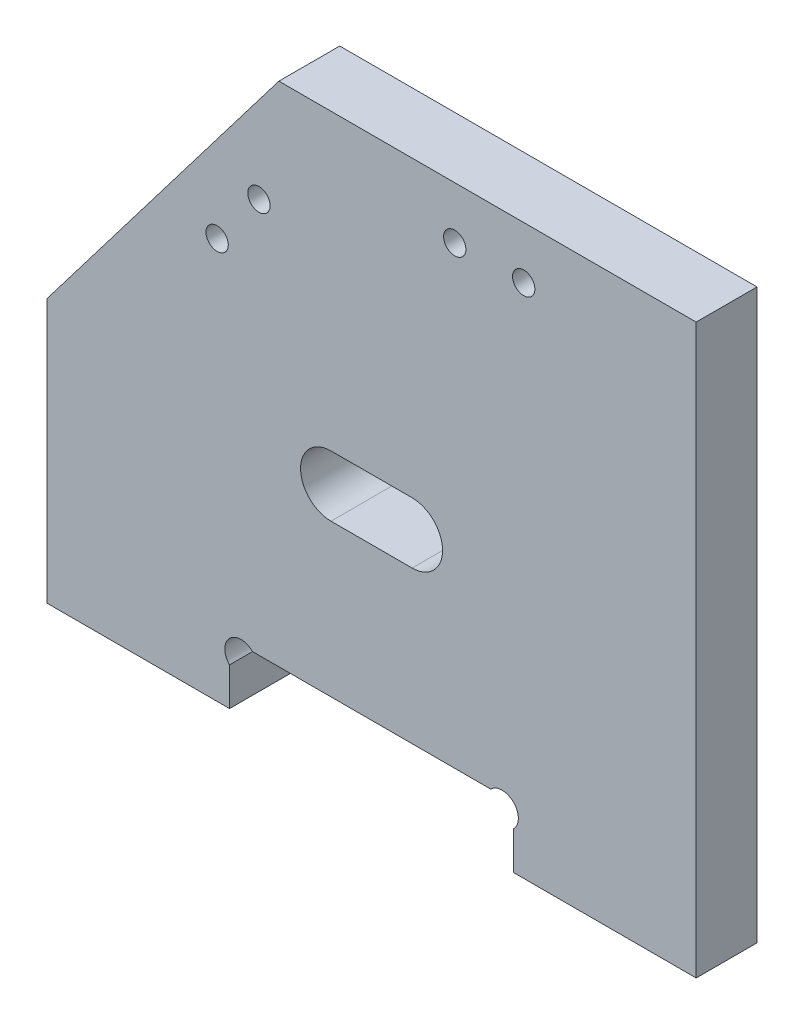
ISO-10303-21;
HEADER;
FILE_DESCRIPTION(('STEP AP214'),'2;1');
FILE_NAME('part.step','',(''),(''),'','','');
FILE_SCHEMA(('AUTOMOTIVE_DESIGN { 1 0 10303 214 1 1 1 1 }'));
ENDSEC;
DATA;
#1=APPLICATION_CONTEXT('core data for automotive mechanical design processes');
#2=APPLICATION_PROTOCOL_DEFINITION('international standard','automotive_design',2000,#1);
#3=PRODUCT_CONTEXT('',#1,'mechanical');
#4=PRODUCT('Part','Part','',(#3));
#5=PRODUCT_RELATED_PRODUCT_CATEGORY('part','',(#4));
#6=PRODUCT_DEFINITION_FORMATION('','',#4);
#7=PRODUCT_DEFINITION_CONTEXT('part definition',#1,'design');
#8=PRODUCT_DEFINITION('design','',#6,#7);
#9=PRODUCT_DEFINITION_SHAPE('','',#8);
#10=(LENGTH_UNIT() NAMED_UNIT(*) SI_UNIT(.MILLI.,.METRE.));
#11=(NAMED_UNIT(*) PLANE_ANGLE_UNIT() SI_UNIT($,.RADIAN.));
#12=(NAMED_UNIT(*) SI_UNIT($,.STERADIAN.) SOLID_ANGLE_UNIT());
#13=UNCERTAINTY_MEASURE_WITH_UNIT(LENGTH_MEASURE(1.E-05),#10,'distance_accuracy_value','');
#14=(GEOMETRIC_REPRESENTATION_CONTEXT(3) GLOBAL_UNCERTAINTY_ASSIGNED_CONTEXT((#13)) GLOBAL_UNIT_ASSIGNED_CONTEXT((#10,
#11,#12)) REPRESENTATION_CONTEXT('',''));
#15=CARTESIAN_POINT('',(0.,0.,0.));
#16=DIRECTION('',(0.,0.,1.));
#17=DIRECTION('',(1.,0.,0.));
#18=AXIS2_PLACEMENT_3D('',#15,#16,#17);
#19=CARTESIAN_POINT('',(-19.1313708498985,4.86862915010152,6.));
#20=DIRECTION('',(0.,0.,-1.));
#21=DIRECTION('',(-1.,0.,0.));
#22=AXIS2_PLACEMENT_3D('',#19,#20,#21);
#23=PLANE('',#22);
#24=CARTESIAN_POINT('',(-17.,50.85,6.));
#25=DIRECTION('',(0.,0.,1.));
#26=DIRECTION('',(1.,0.,0.));
#27=AXIS2_PLACEMENT_3D('',#24,#25,#26);
#28=CIRCLE('',#27,1.09999999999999);
#29=CARTESIAN_POINT('',(-15.9,50.85,6.));
#30=VERTEX_POINT('',#29);
#31=EDGE_CURVE('E180',#30,#30,#28,.T.);
#32=ORIENTED_EDGE('',*,*,#31,.F.);
#33=EDGE_LOOP('',(#32));
#34=FACE_BOUND('',#33,.T.);
#35=CARTESIAN_POINT('',(-43.1029772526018,44.9247677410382,6.));
#36=DIRECTION('',(0.,0.,1.));
#37=DIRECTION('',(1.,0.,0.));
#38=AXIS2_PLACEMENT_3D('',#35,#36,#37);
#39=CIRCLE('',#38,1.1);
#40=CARTESIAN_POINT('',(-42.0029772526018,44.9247677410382,6.));
#41=VERTEX_POINT('',#40);
#42=EDGE_CURVE('E192',#41,#41,#39,.T.);
#43=ORIENTED_EDGE('',*,*,#42,.F.);
#44=EDGE_LOOP('',(#43));
#45=FACE_BOUND('',#44,.T.);
#46=DIRECTION('',(-0.606127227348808,-0.795367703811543,0.));
#47=VECTOR('',#46,1.);
#48=CARTESIAN_POINT('',(-64.,26.,6.));
#49=LINE('',#48,#47);
#50=CARTESIAN_POINT('',(-41.1378486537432,56.,6.));
#51=VERTEX_POINT('',#50);
#52=CARTESIAN_POINT('',(-64.,26.,6.));
#53=VERTEX_POINT('',#52);
#54=EDGE_CURVE('E204',#51,#53,#49,.T.);
#55=ORIENTED_EDGE('',*,*,#54,.T.);
#56=DIRECTION('',(0.,-1.,0.));
#57=VECTOR('',#56,1.);
#58=CARTESIAN_POINT('',(-64.,0.,6.));
#59=LINE('',#58,#57);
#60=CARTESIAN_POINT('',(-64.,0.,6.));
#61=VERTEX_POINT('',#60);
#62=EDGE_CURVE('E207',#53,#61,#59,.T.);
#63=ORIENTED_EDGE('',*,*,#62,.T.);
#64=DIRECTION('',(1.,0.,0.));
#65=VECTOR('',#64,1.);
#66=CARTESIAN_POINT('',(-46.,0.,6.));
#67=LINE('',#66,#65);
#68=CARTESIAN_POINT('',(-46.,0.,6.));
#69=VERTEX_POINT('',#68);
#70=EDGE_CURVE('E210',#61,#69,#67,.T.);
#71=ORIENTED_EDGE('',*,*,#70,.T.);
#72=DIRECTION('',(0.,1.,0.));
#73=VECTOR('',#72,1.);
#74=CARTESIAN_POINT('',(-46.,3.73725830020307,6.));
#75=LINE('',#74,#73);
#76=CARTESIAN_POINT('',(-46.,3.73725830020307,6.));
#77=VERTEX_POINT('',#76);
#78=EDGE_CURVE('E212',#69,#77,#75,.T.);
#79=ORIENTED_EDGE('',*,*,#78,.T.);
#80=CARTESIAN_POINT('',(-44.8686291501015,4.86862915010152,6.));
#81=DIRECTION('',(0.,0.,-1.));
#82=DIRECTION('',(1.,0.,0.));
#83=AXIS2_PLACEMENT_3D('',#80,#81,#82);
#84=CIRCLE('',#83,1.59999999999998);
#85=CARTESIAN_POINT('',(-43.7372583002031,5.99999999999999,6.));
#86=VERTEX_POINT('',#85);
#87=EDGE_CURVE('E214',#77,#86,#84,.T.);
#88=ORIENTED_EDGE('',*,*,#87,.T.);
#89=DIRECTION('',(1.,0.,0.));
#90=VECTOR('',#89,1.);
#91=CARTESIAN_POINT('',(-43.7372583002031,5.99999999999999,6.));
#92=LINE('',#91,#90);
#93=CARTESIAN_POINT('',(-20.2627416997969,5.99999999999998,6.));
#94=VERTEX_POINT('',#93);
#95=EDGE_CURVE('E216',#86,#94,#92,.T.);
#96=ORIENTED_EDGE('',*,*,#95,.T.);
#97=CARTESIAN_POINT('',(-19.1313708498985,4.86862915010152,6.));
#98=DIRECTION('',(0.,0.,-1.));
#99=DIRECTION('',(-1.,0.,0.));
#100=AXIS2_PLACEMENT_3D('',#97,#98,#99);
#101=CIRCLE('',#100,1.59999999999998);
#102=CARTESIAN_POINT('',(-18.,3.73725830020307,6.));
#103=VERTEX_POINT('',#102);
#104=EDGE_CURVE('E218',#94,#103,#101,.T.);
#105=ORIENTED_EDGE('',*,*,#104,.T.);
#106=DIRECTION('',(0.,-1.,0.));
#107=VECTOR('',#106,1.);
#108=CARTESIAN_POINT('',(-18.,3.73725830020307,6.));
#109=LINE('',#108,#107);
#110=CARTESIAN_POINT('',(-18.,0.,6.));
#111=VERTEX_POINT('',#110);
#112=EDGE_CURVE('E220',#103,#111,#109,.T.);
#113=ORIENTED_EDGE('',*,*,#112,.T.);
#114=DIRECTION('',(1.,0.,0.));
#115=VECTOR('',#114,1.);
#116=CARTESIAN_POINT('',(0.,0.,6.));
#117=LINE('',#116,#115);
#118=CARTESIAN_POINT('',(0.,0.,6.));
#119=VERTEX_POINT('',#118);
#120=EDGE_CURVE('E222',#111,#119,#117,.T.);
#121=ORIENTED_EDGE('',*,*,#120,.T.);
#122=DIRECTION('',(0.,1.,0.));
#123=VECTOR('',#122,1.);
#124=CARTESIAN_POINT('',(0.,56.,6.));
#125=LINE('',#124,#123);
#126=CARTESIAN_POINT('',(0.,56.,6.));
#127=VERTEX_POINT('',#126);
#128=EDGE_CURVE('E224',#119,#127,#125,.T.);
#129=ORIENTED_EDGE('',*,*,#128,.T.);
#130=DIRECTION('',(-1.,0.,0.));
#131=VECTOR('',#130,1.);
#132=CARTESIAN_POINT('',(-41.1378486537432,56.,6.));
#133=LINE('',#132,#131);
#134=EDGE_CURVE('E226',#127,#51,#133,.T.);
#135=ORIENTED_EDGE('',*,*,#134,.T.);
#136=EDGE_LOOP('',(#55,#63,#71,#79,#88,#96,#105,#113,#121,#129,#135));
#137=FACE_BOUND('',#136,.T.);
#138=CARTESIAN_POINT('',(-47.2246423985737,39.5162673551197,6.));
#139=DIRECTION('',(0.,0.,1.));
#140=DIRECTION('',(1.,0.,0.));
#141=AXIS2_PLACEMENT_3D('',#138,#139,#140);
#142=CIRCLE('',#141,1.1);
#143=CARTESIAN_POINT('',(-46.1246423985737,39.5162673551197,6.));
#144=VERTEX_POINT('',#143);
#145=EDGE_CURVE('E198',#144,#144,#142,.T.);
#146=ORIENTED_EDGE('',*,*,#145,.F.);
#147=EDGE_LOOP('',(#146));
#148=FACE_BOUND('',#147,.T.);
#149=CARTESIAN_POINT('',(-23.8,50.85,6.));
#150=DIRECTION('',(0.,0.,1.));
#151=DIRECTION('',(1.,0.,0.));
#152=AXIS2_PLACEMENT_3D('',#149,#150,#151);
#153=CIRCLE('',#152,1.09999999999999);
#154=CARTESIAN_POINT('',(-22.7,50.85,6.));
#155=VERTEX_POINT('',#154);
#156=EDGE_CURVE('E186',#155,#155,#153,.T.);
#157=ORIENTED_EDGE('',*,*,#156,.F.);
#158=EDGE_LOOP('',(#157));
#159=FACE_BOUND('',#158,.T.);
#160=CARTESIAN_POINT('',(-28.,24.,6.));
#161=DIRECTION('',(0.,0.,1.));
#162=DIRECTION('',(1.,0.,0.));
#163=AXIS2_PLACEMENT_3D('',#160,#161,#162);
#164=CIRCLE('',#163,3.);
#165=CARTESIAN_POINT('',(-28.,21.,6.));
#166=VERTEX_POINT('',#165);
#167=CARTESIAN_POINT('',(-28.,27.,6.));
#168=VERTEX_POINT('',#167);
#169=EDGE_CURVE('E144',#166,#168,#164,.T.);
#170=ORIENTED_EDGE('',*,*,#169,.F.);
#171=DIRECTION('',(1.,0.,0.));
#172=VECTOR('',#171,1.);
#173=CARTESIAN_POINT('',(-36.,21.,6.));
#174=LINE('',#173,#172);
#175=CARTESIAN_POINT('',(-36.,21.,6.));
#176=VERTEX_POINT('',#175);
#177=EDGE_CURVE('E166',#176,#166,#174,.T.);
#178=ORIENTED_EDGE('',*,*,#177,.F.);
#179=CARTESIAN_POINT('',(-36.,24.,6.));
#180=DIRECTION('',(0.,0.,1.));
#181=DIRECTION('',(-1.,0.,0.));
#182=AXIS2_PLACEMENT_3D('',#179,#180,#181);
#183=CIRCLE('',#182,3.);
#184=CARTESIAN_POINT('',(-36.,27.,6.));
#185=VERTEX_POINT('',#184);
#186=EDGE_CURVE('E164',#185,#176,#183,.T.);
#187=ORIENTED_EDGE('',*,*,#186,.F.);
#188=DIRECTION('',(-1.,0.,0.));
#189=VECTOR('',#188,1.);
#190=CARTESIAN_POINT('',(-36.,27.,6.));
#191=LINE('',#190,#189);
#192=EDGE_CURVE('E152',#168,#185,#191,.T.);
#193=ORIENTED_EDGE('',*,*,#192,.F.);
#194=EDGE_LOOP('',(#170,#178,#187,#193));
#195=FACE_BOUND('',#194,.T.);
#196=ADVANCED_FACE('F37',(#34,#45,#137,#148,#159,#195),#23,.F.);
#197=CARTESIAN_POINT('',(-19.1313708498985,4.86862915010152,0.));
#198=DIRECTION('',(0.,0.,-1.));
#199=DIRECTION('',(-1.,0.,0.));
#200=AXIS2_PLACEMENT_3D('',#197,#198,#199);
#201=PLANE('',#200);
#202=CARTESIAN_POINT('',(-17.,50.85,0.));
#203=DIRECTION('',(0.,0.,1.));
#204=DIRECTION('',(1.,0.,0.));
#205=AXIS2_PLACEMENT_3D('',#202,#203,#204);
#206=CIRCLE('',#205,1.09999999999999);
#207=CARTESIAN_POINT('',(-15.9,50.85,0.));
#208=VERTEX_POINT('',#207);
#209=EDGE_CURVE('E160',#208,#208,#206,.T.);
#210=ORIENTED_EDGE('',*,*,#209,.T.);
#211=EDGE_LOOP('',(#210));
#212=FACE_BOUND('',#211,.T.);
#213=CARTESIAN_POINT('',(-43.1029772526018,44.9247677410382,0.));
#214=DIRECTION('',(0.,0.,1.));
#215=DIRECTION('',(1.,0.,0.));
#216=AXIS2_PLACEMENT_3D('',#213,#214,#215);
#217=CIRCLE('',#216,1.1);
#218=CARTESIAN_POINT('',(-42.0029772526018,44.9247677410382,0.));
#219=VERTEX_POINT('',#218);
#220=EDGE_CURVE('E189',#219,#219,#217,.T.);
#221=ORIENTED_EDGE('',*,*,#220,.T.);
#222=EDGE_LOOP('',(#221));
#223=FACE_BOUND('',#222,.T.);
#224=DIRECTION('',(-0.606127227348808,-0.795367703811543,0.));
#225=VECTOR('',#224,1.);
#226=CARTESIAN_POINT('',(-64.,26.,0.));
#227=LINE('',#226,#225);
#228=CARTESIAN_POINT('',(-41.1378486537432,56.,0.));
#229=VERTEX_POINT('',#228);
#230=CARTESIAN_POINT('',(-64.,26.,0.));
#231=VERTEX_POINT('',#230);
#232=EDGE_CURVE('E201',#229,#231,#227,.T.);
#233=ORIENTED_EDGE('',*,*,#232,.F.);
#234=DIRECTION('',(-1.,0.,0.));
#235=VECTOR('',#234,1.);
#236=CARTESIAN_POINT('',(-41.1378486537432,56.,0.));
#237=LINE('',#236,#235);
#238=CARTESIAN_POINT('',(0.,56.,0.));
#239=VERTEX_POINT('',#238);
#240=EDGE_CURVE('E208',#239,#229,#237,.T.);
#241=ORIENTED_EDGE('',*,*,#240,.F.);
#242=DIRECTION('',(0.,1.,0.));
#243=VECTOR('',#242,1.);
#244=CARTESIAN_POINT('',(0.,56.,0.));
#245=LINE('',#244,#243);
#246=CARTESIAN_POINT('',(0.,0.,0.));
#247=VERTEX_POINT('',#246);
#248=EDGE_CURVE('E247',#247,#239,#245,.T.);
#249=ORIENTED_EDGE('',*,*,#248,.F.);
#250=DIRECTION('',(1.,0.,0.));
#251=VECTOR('',#250,1.);
#252=CARTESIAN_POINT('',(0.,0.,0.));
#253=LINE('',#252,#251);
#254=CARTESIAN_POINT('',(-18.,0.,0.));
#255=VERTEX_POINT('',#254);
#256=EDGE_CURVE('E245',#255,#247,#253,.T.);
#257=ORIENTED_EDGE('',*,*,#256,.F.);
#258=DIRECTION('',(0.,-1.,0.));
#259=VECTOR('',#258,1.);
#260=CARTESIAN_POINT('',(-18.,3.73725830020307,0.));
#261=LINE('',#260,#259);
#262=CARTESIAN_POINT('',(-18.,3.73725830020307,0.));
#263=VERTEX_POINT('',#262);
#264=EDGE_CURVE('E243',#263,#255,#261,.T.);
#265=ORIENTED_EDGE('',*,*,#264,.F.);
#266=CARTESIAN_POINT('',(-19.1313708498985,4.86862915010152,0.));
#267=DIRECTION('',(0.,0.,-1.));
#268=DIRECTION('',(-1.,0.,0.));
#269=AXIS2_PLACEMENT_3D('',#266,#267,#268);
#270=CIRCLE('',#269,1.59999999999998);
#271=CARTESIAN_POINT('',(-20.2627416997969,5.99999999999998,0.));
#272=VERTEX_POINT('',#271);
#273=EDGE_CURVE('E241',#272,#263,#270,.T.);
#274=ORIENTED_EDGE('',*,*,#273,.F.);
#275=DIRECTION('',(1.,0.,0.));
#276=VECTOR('',#275,1.);
#277=CARTESIAN_POINT('',(-43.7372583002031,5.99999999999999,0.));
#278=LINE('',#277,#276);
#279=CARTESIAN_POINT('',(-43.7372583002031,5.99999999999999,0.));
#280=VERTEX_POINT('',#279);
#281=EDGE_CURVE('E239',#280,#272,#278,.T.);
#282=ORIENTED_EDGE('',*,*,#281,.F.);
#283=CARTESIAN_POINT('',(-44.8686291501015,4.86862915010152,0.));
#284=DIRECTION('',(0.,0.,-1.));
#285=DIRECTION('',(1.,0.,0.));
#286=AXIS2_PLACEMENT_3D('',#283,#284,#285);
#287=CIRCLE('',#286,1.59999999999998);
#288=CARTESIAN_POINT('',(-46.,3.73725830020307,0.));
#289=VERTEX_POINT('',#288);
#290=EDGE_CURVE('E237',#289,#280,#287,.T.);
#291=ORIENTED_EDGE('',*,*,#290,.F.);
#292=DIRECTION('',(0.,1.,0.));
#293=VECTOR('',#292,1.);
#294=CARTESIAN_POINT('',(-46.,3.73725830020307,0.));
#295=LINE('',#294,#293);
#296=CARTESIAN_POINT('',(-46.,0.,0.));
#297=VERTEX_POINT('',#296);
#298=EDGE_CURVE('E235',#297,#289,#295,.T.);
#299=ORIENTED_EDGE('',*,*,#298,.F.);
#300=DIRECTION('',(1.,0.,0.));
#301=VECTOR('',#300,1.);
#302=CARTESIAN_POINT('',(-46.,0.,0.));
#303=LINE('',#302,#301);
#304=CARTESIAN_POINT('',(-64.,0.,0.));
#305=VERTEX_POINT('',#304);
#306=EDGE_CURVE('E233',#305,#297,#303,.T.);
#307=ORIENTED_EDGE('',*,*,#306,.F.);
#308=DIRECTION('',(0.,-1.,0.));
#309=VECTOR('',#308,1.);
#310=CARTESIAN_POINT('',(-64.,0.,0.));
#311=LINE('',#310,#309);
#312=EDGE_CURVE('E231',#231,#305,#311,.T.);
#313=ORIENTED_EDGE('',*,*,#312,.F.);
#314=EDGE_LOOP('',(#233,#241,#249,#257,#265,#274,#282,#291,#299,#307,#313));
#315=FACE_BOUND('',#314,.T.);
#316=CARTESIAN_POINT('',(-47.2246423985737,39.5162673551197,0.));
#317=DIRECTION('',(0.,0.,1.));
#318=DIRECTION('',(1.,0.,0.));
#319=AXIS2_PLACEMENT_3D('',#316,#317,#318);
#320=CIRCLE('',#319,1.1);
#321=CARTESIAN_POINT('',(-46.1246423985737,39.5162673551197,0.));
#322=VERTEX_POINT('',#321);
#323=EDGE_CURVE('E195',#322,#322,#320,.T.);
#324=ORIENTED_EDGE('',*,*,#323,.T.);
#325=EDGE_LOOP('',(#324));
#326=FACE_BOUND('',#325,.T.);
#327=CARTESIAN_POINT('',(-23.8,50.85,0.));
#328=DIRECTION('',(0.,0.,1.));
#329=DIRECTION('',(1.,0.,0.));
#330=AXIS2_PLACEMENT_3D('',#327,#328,#329);
#331=CIRCLE('',#330,1.09999999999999);
#332=CARTESIAN_POINT('',(-22.7,50.85,0.));
#333=VERTEX_POINT('',#332);
#334=EDGE_CURVE('E183',#333,#333,#331,.T.);
#335=ORIENTED_EDGE('',*,*,#334,.T.);
#336=EDGE_LOOP('',(#335));
#337=FACE_BOUND('',#336,.T.);
#338=DIRECTION('',(1.,0.,0.));
#339=VECTOR('',#338,1.);
#340=CARTESIAN_POINT('',(-36.,21.,0.));
#341=LINE('',#340,#339);
#342=CARTESIAN_POINT('',(-36.,21.,0.));
#343=VERTEX_POINT('',#342);
#344=CARTESIAN_POINT('',(-28.,21.,0.));
#345=VERTEX_POINT('',#344);
#346=EDGE_CURVE('E153',#343,#345,#341,.T.);
#347=ORIENTED_EDGE('',*,*,#346,.T.);
#348=CARTESIAN_POINT('',(-28.,24.,0.));
#349=DIRECTION('',(0.,0.,1.));
#350=DIRECTION('',(1.,0.,0.));
#351=AXIS2_PLACEMENT_3D('',#348,#349,#350);
#352=CIRCLE('',#351,3.);
#353=CARTESIAN_POINT('',(-28.,27.,0.));
#354=VERTEX_POINT('',#353);
#355=EDGE_CURVE('E60',#345,#354,#352,.T.);
#356=ORIENTED_EDGE('',*,*,#355,.T.);
#357=DIRECTION('',(-1.,0.,0.));
#358=VECTOR('',#357,1.);
#359=CARTESIAN_POINT('',(-36.,27.,0.));
#360=LINE('',#359,#358);
#361=CARTESIAN_POINT('',(-36.,27.,0.));
#362=VERTEX_POINT('',#361);
#363=EDGE_CURVE('E159',#354,#362,#360,.T.);
#364=ORIENTED_EDGE('',*,*,#363,.T.);
#365=CARTESIAN_POINT('',(-36.,24.,0.));
#366=DIRECTION('',(0.,0.,1.));
#367=DIRECTION('',(-1.,0.,0.));
#368=AXIS2_PLACEMENT_3D('',#365,#366,#367);
#369=CIRCLE('',#368,3.);
#370=EDGE_CURVE('E172',#362,#343,#369,.T.);
#371=ORIENTED_EDGE('',*,*,#370,.T.);
#372=EDGE_LOOP('',(#347,#356,#364,#371));
#373=FACE_BOUND('',#372,.T.);
#374=ADVANCED_FACE('F286',(#212,#223,#315,#326,#337,#373),#201,.T.);
#375=CARTESIAN_POINT('',(-64.,26.,6.));
#376=DIRECTION('',(0.795367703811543,-0.606127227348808,0.));
#377=DIRECTION('',(0.606127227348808,0.795367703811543,0.));
#378=AXIS2_PLACEMENT_3D('',#375,#376,#377);
#379=PLANE('',#378);
#380=ORIENTED_EDGE('',*,*,#232,.T.);
#381=DIRECTION('',(0.,0.,-1.));
#382=VECTOR('',#381,1.);
#383=CARTESIAN_POINT('',(-64.,26.,6.));
#384=LINE('',#383,#382);
#385=EDGE_CURVE('E11',#53,#231,#384,.T.);
#386=ORIENTED_EDGE('',*,*,#385,.F.);
#387=ORIENTED_EDGE('',*,*,#54,.F.);
#388=DIRECTION('',(0.,0.,-1.));
#389=VECTOR('',#388,1.);
#390=CARTESIAN_POINT('',(-41.1378486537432,56.,6.));
#391=LINE('',#390,#389);
#392=EDGE_CURVE('E228',#51,#229,#391,.T.);
#393=ORIENTED_EDGE('',*,*,#392,.T.);
#394=EDGE_LOOP('',(#380,#386,#387,#393));
#395=FACE_BOUND('',#394,.T.);
#396=ADVANCED_FACE('F39',(#395),#379,.F.);
#397=CARTESIAN_POINT('',(-64.,0.,6.));
#398=DIRECTION('',(1.,0.,0.));
#399=DIRECTION('',(0.,0.,-1.));
#400=AXIS2_PLACEMENT_3D('',#397,#398,#399);
#401=PLANE('',#400);
#402=ORIENTED_EDGE('',*,*,#312,.T.);
#403=DIRECTION('',(0.,0.,-1.));
#404=VECTOR('',#403,1.);
#405=CARTESIAN_POINT('',(-64.,0.,6.));
#406=LINE('',#405,#404);
#407=EDGE_CURVE('E45',#61,#305,#406,.T.);
#408=ORIENTED_EDGE('',*,*,#407,.F.);
#409=ORIENTED_EDGE('',*,*,#62,.F.);
#410=ORIENTED_EDGE('',*,*,#385,.T.);
#411=EDGE_LOOP('',(#402,#408,#409,#410));
#412=FACE_BOUND('',#411,.T.);
#413=ADVANCED_FACE('F304',(#412),#401,.F.);
#414=CARTESIAN_POINT('',(-46.,0.,6.));
#415=DIRECTION('',(0.,1.,0.));
#416=DIRECTION('',(-1.,0.,0.));
#417=AXIS2_PLACEMENT_3D('',#414,#415,#416);
#418=PLANE('',#417);
#419=ORIENTED_EDGE('',*,*,#306,.T.);
#420=DIRECTION('',(0.,0.,-1.));
#421=VECTOR('',#420,1.);
#422=CARTESIAN_POINT('',(-46.,0.,6.));
#423=LINE('',#422,#421);
#424=EDGE_CURVE('E273',#69,#297,#423,.T.);
#425=ORIENTED_EDGE('',*,*,#424,.F.);
#426=ORIENTED_EDGE('',*,*,#70,.F.);
#427=ORIENTED_EDGE('',*,*,#407,.T.);
#428=EDGE_LOOP('',(#419,#425,#426,#427));
#429=FACE_BOUND('',#428,.T.);
#430=ADVANCED_FACE('F280',(#429),#418,.F.);
#431=CARTESIAN_POINT('',(-46.,3.73725830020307,6.));
#432=DIRECTION('',(-1.,0.,0.));
#433=DIRECTION('',(0.,-1.,0.));
#434=AXIS2_PLACEMENT_3D('',#431,#432,#433);
#435=PLANE('',#434);
#436=ORIENTED_EDGE('',*,*,#298,.T.);
#437=DIRECTION('',(0.,0.,-1.));
#438=VECTOR('',#437,1.);
#439=CARTESIAN_POINT('',(-46.,3.73725830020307,6.));
#440=LINE('',#439,#438);
#441=EDGE_CURVE('E270',#77,#289,#440,.T.);
#442=ORIENTED_EDGE('',*,*,#441,.F.);
#443=ORIENTED_EDGE('',*,*,#78,.F.);
#444=ORIENTED_EDGE('',*,*,#424,.T.);
#445=EDGE_LOOP('',(#436,#442,#443,#444));
#446=FACE_BOUND('',#445,.T.);
#447=ADVANCED_FACE('F292',(#446),#435,.F.);
#448=CARTESIAN_POINT('',(-44.8686291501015,4.86862915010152,6.));
#449=DIRECTION('',(0.,0.,-1.));
#450=DIRECTION('',(-1.,0.,0.));
#451=AXIS2_PLACEMENT_3D('',#448,#449,#450);
#452=CYLINDRICAL_SURFACE('',#451,1.59999999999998);
#453=ORIENTED_EDGE('',*,*,#290,.T.);
#454=DIRECTION('',(0.,0.,-1.));
#455=VECTOR('',#454,1.);
#456=CARTESIAN_POINT('',(-43.7372583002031,5.99999999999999,6.));
#457=LINE('',#456,#455);
#458=EDGE_CURVE('E267',#86,#280,#457,.T.);
#459=ORIENTED_EDGE('',*,*,#458,.F.);
#460=ORIENTED_EDGE('',*,*,#87,.F.);
#461=ORIENTED_EDGE('',*,*,#441,.T.);
#462=EDGE_LOOP('',(#453,#459,#460,#461));
#463=FACE_BOUND('',#462,.T.);
#464=ADVANCED_FACE('F296',(#463),#452,.F.);
#465=CARTESIAN_POINT('',(-43.7372583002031,5.99999999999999,6.));
#466=DIRECTION('',(0.,1.,0.));
#467=DIRECTION('',(-1.,0.,0.));
#468=AXIS2_PLACEMENT_3D('',#465,#466,#467);
#469=PLANE('',#468);
#470=ORIENTED_EDGE('',*,*,#281,.T.);
#471=DIRECTION('',(0.,0.,-1.));
#472=VECTOR('',#471,1.);
#473=CARTESIAN_POINT('',(-20.2627416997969,5.99999999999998,6.));
#474=LINE('',#473,#472);
#475=EDGE_CURVE('E264',#94,#272,#474,.T.);
#476=ORIENTED_EDGE('',*,*,#475,.F.);
#477=ORIENTED_EDGE('',*,*,#95,.F.);
#478=ORIENTED_EDGE('',*,*,#458,.T.);
#479=EDGE_LOOP('',(#470,#476,#477,#478));
#480=FACE_BOUND('',#479,.T.);
#481=ADVANCED_FACE('F332',(#480),#469,.F.);
#482=CARTESIAN_POINT('',(-19.1313708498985,4.86862915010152,6.));
#483=DIRECTION('',(0.,0.,-1.));
#484=DIRECTION('',(-1.,0.,0.));
#485=AXIS2_PLACEMENT_3D('',#482,#483,#484);
#486=CYLINDRICAL_SURFACE('',#485,1.59999999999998);
#487=ORIENTED_EDGE('',*,*,#273,.T.);
#488=DIRECTION('',(0.,0.,-1.));
#489=VECTOR('',#488,1.);
#490=CARTESIAN_POINT('',(-18.,3.73725830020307,6.));
#491=LINE('',#490,#489);
#492=EDGE_CURVE('E261',#103,#263,#491,.T.);
#493=ORIENTED_EDGE('',*,*,#492,.F.);
#494=ORIENTED_EDGE('',*,*,#104,.F.);
#495=ORIENTED_EDGE('',*,*,#475,.T.);
#496=EDGE_LOOP('',(#487,#493,#494,#495));
#497=FACE_BOUND('',#496,.T.);
#498=ADVANCED_FACE('F330',(#497),#486,.F.);
#499=CARTESIAN_POINT('',(-18.,3.73725830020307,6.));
#500=DIRECTION('',(1.,0.,0.));
#501=DIRECTION('',(0.,1.,0.));
#502=AXIS2_PLACEMENT_3D('',#499,#500,#501);
#503=PLANE('',#502);
#504=ORIENTED_EDGE('',*,*,#264,.T.);
#505=DIRECTION('',(0.,0.,-1.));
#506=VECTOR('',#505,1.);
#507=CARTESIAN_POINT('',(-18.,0.,6.));
#508=LINE('',#507,#506);
#509=EDGE_CURVE('E258',#111,#255,#508,.T.);
#510=ORIENTED_EDGE('',*,*,#509,.F.);
#511=ORIENTED_EDGE('',*,*,#112,.F.);
#512=ORIENTED_EDGE('',*,*,#492,.T.);
#513=EDGE_LOOP('',(#504,#510,#511,#512));
#514=FACE_BOUND('',#513,.T.);
#515=ADVANCED_FACE('F325',(#514),#503,.F.);
#516=CARTESIAN_POINT('',(0.,0.,6.));
#517=DIRECTION('',(0.,1.,0.));
#518=DIRECTION('',(-1.,0.,0.));
#519=AXIS2_PLACEMENT_3D('',#516,#517,#518);
#520=PLANE('',#519);
#521=ORIENTED_EDGE('',*,*,#256,.T.);
#522=DIRECTION('',(0.,0.,-1.));
#523=VECTOR('',#522,1.);
#524=CARTESIAN_POINT('',(0.,0.,6.));
#525=LINE('',#524,#523);
#526=EDGE_CURVE('E255',#119,#247,#525,.T.);
#527=ORIENTED_EDGE('',*,*,#526,.F.);
#528=ORIENTED_EDGE('',*,*,#120,.F.);
#529=ORIENTED_EDGE('',*,*,#509,.T.);
#530=EDGE_LOOP('',(#521,#527,#528,#529));
#531=FACE_BOUND('',#530,.T.);
#532=ADVANCED_FACE('F320',(#531),#520,.F.);
#533=CARTESIAN_POINT('',(0.,56.,6.));
#534=DIRECTION('',(-1.,0.,0.));
#535=DIRECTION('',(0.,-1.,0.));
#536=AXIS2_PLACEMENT_3D('',#533,#534,#535);
#537=PLANE('',#536);
#538=ORIENTED_EDGE('',*,*,#248,.T.);
#539=DIRECTION('',(0.,0.,-1.));
#540=VECTOR('',#539,1.);
#541=CARTESIAN_POINT('',(0.,56.,6.));
#542=LINE('',#541,#540);
#543=EDGE_CURVE('E252',#127,#239,#542,.T.);
#544=ORIENTED_EDGE('',*,*,#543,.F.);
#545=ORIENTED_EDGE('',*,*,#128,.F.);
#546=ORIENTED_EDGE('',*,*,#526,.T.);
#547=EDGE_LOOP('',(#538,#544,#545,#546));
#548=FACE_BOUND('',#547,.T.);
#549=ADVANCED_FACE('F316',(#548),#537,.F.);
#550=CARTESIAN_POINT('',(-41.1378486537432,56.,6.));
#551=DIRECTION('',(0.,-1.,0.));
#552=DIRECTION('',(1.,0.,0.));
#553=AXIS2_PLACEMENT_3D('',#550,#551,#552);
#554=PLANE('',#553);
#555=ORIENTED_EDGE('',*,*,#240,.T.);
#556=ORIENTED_EDGE('',*,*,#392,.F.);
#557=ORIENTED_EDGE('',*,*,#134,.F.);
#558=ORIENTED_EDGE('',*,*,#543,.T.);
#559=EDGE_LOOP('',(#555,#556,#557,#558));
#560=FACE_BOUND('',#559,.T.);
#561=ADVANCED_FACE('F311',(#560),#554,.F.);
#562=CARTESIAN_POINT('',(-47.2246423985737,39.5162673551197,6.));
#563=DIRECTION('',(0.,0.,-1.));
#564=DIRECTION('',(-1.,0.,0.));
#565=AXIS2_PLACEMENT_3D('',#562,#563,#564);
#566=CYLINDRICAL_SURFACE('',#565,1.1);
#567=ORIENTED_EDGE('',*,*,#145,.T.);
#568=EDGE_LOOP('',(#567));
#569=FACE_BOUND('',#568,.T.);
#570=ORIENTED_EDGE('',*,*,#323,.F.);
#571=EDGE_LOOP('',(#570));
#572=FACE_BOUND('',#571,.T.);
#573=ADVANCED_FACE('F352',(#569,#572),#566,.F.);
#574=CARTESIAN_POINT('',(-43.1029772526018,44.9247677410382,6.));
#575=DIRECTION('',(0.,0.,-1.));
#576=DIRECTION('',(-1.,0.,0.));
#577=AXIS2_PLACEMENT_3D('',#574,#575,#576);
#578=CYLINDRICAL_SURFACE('',#577,1.1);
#579=ORIENTED_EDGE('',*,*,#42,.T.);
#580=EDGE_LOOP('',(#579));
#581=FACE_BOUND('',#580,.T.);
#582=ORIENTED_EDGE('',*,*,#220,.F.);
#583=EDGE_LOOP('',(#582));
#584=FACE_BOUND('',#583,.T.);
#585=ADVANCED_FACE('F384',(#581,#584),#578,.F.);
#586=CARTESIAN_POINT('',(-23.8,50.85,6.));
#587=DIRECTION('',(0.,0.,-1.));
#588=DIRECTION('',(-1.,0.,0.));
#589=AXIS2_PLACEMENT_3D('',#586,#587,#588);
#590=CYLINDRICAL_SURFACE('',#589,1.09999999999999);
#591=ORIENTED_EDGE('',*,*,#156,.T.);
#592=EDGE_LOOP('',(#591));
#593=FACE_BOUND('',#592,.T.);
#594=ORIENTED_EDGE('',*,*,#334,.F.);
#595=EDGE_LOOP('',(#594));
#596=FACE_BOUND('',#595,.T.);
#597=ADVANCED_FACE('F391',(#593,#596),#590,.F.);
#598=CARTESIAN_POINT('',(-17.,50.85,6.));
#599=DIRECTION('',(0.,0.,-1.));
#600=DIRECTION('',(-1.,0.,0.));
#601=AXIS2_PLACEMENT_3D('',#598,#599,#600);
#602=CYLINDRICAL_SURFACE('',#601,1.09999999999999);
#603=ORIENTED_EDGE('',*,*,#31,.T.);
#604=EDGE_LOOP('',(#603));
#605=FACE_BOUND('',#604,.T.);
#606=ORIENTED_EDGE('',*,*,#209,.F.);
#607=EDGE_LOOP('',(#606));
#608=FACE_BOUND('',#607,.T.);
#609=ADVANCED_FACE('F398',(#605,#608),#602,.F.);
#610=CARTESIAN_POINT('',(-28.,24.,6.));
#611=DIRECTION('',(0.,0.,-1.));
#612=DIRECTION('',(-1.,0.,0.));
#613=AXIS2_PLACEMENT_3D('',#610,#611,#612);
#614=CYLINDRICAL_SURFACE('',#613,3.);
#615=ORIENTED_EDGE('',*,*,#355,.F.);
#616=DIRECTION('',(0.,0.,-1.));
#617=VECTOR('',#616,1.);
#618=CARTESIAN_POINT('',(-28.,21.,6.));
#619=LINE('',#618,#617);
#620=EDGE_CURVE('E148',#166,#345,#619,.T.);
#621=ORIENTED_EDGE('',*,*,#620,.F.);
#622=ORIENTED_EDGE('',*,*,#169,.T.);
#623=DIRECTION('',(0.,0.,-1.));
#624=VECTOR('',#623,1.);
#625=CARTESIAN_POINT('',(-28.,27.,6.));
#626=LINE('',#625,#624);
#627=EDGE_CURVE('E147',#168,#354,#626,.T.);
#628=ORIENTED_EDGE('',*,*,#627,.T.);
#629=EDGE_LOOP('',(#615,#621,#622,#628));
#630=FACE_BOUND('',#629,.T.);
#631=ADVANCED_FACE('F146',(#630),#614,.F.);
#632=CARTESIAN_POINT('',(-36.,27.,6.));
#633=DIRECTION('',(0.,-1.,0.));
#634=DIRECTION('',(0.,0.,-1.));
#635=AXIS2_PLACEMENT_3D('',#632,#633,#634);
#636=PLANE('',#635);
#637=ORIENTED_EDGE('',*,*,#363,.F.);
#638=ORIENTED_EDGE('',*,*,#627,.F.);
#639=ORIENTED_EDGE('',*,*,#192,.T.);
#640=DIRECTION('',(0.,0.,-1.));
#641=VECTOR('',#640,1.);
#642=CARTESIAN_POINT('',(-36.,27.,6.));
#643=LINE('',#642,#641);
#644=EDGE_CURVE('E161',#185,#362,#643,.T.);
#645=ORIENTED_EDGE('',*,*,#644,.T.);
#646=EDGE_LOOP('',(#637,#638,#639,#645));
#647=FACE_BOUND('',#646,.T.);
#648=ADVANCED_FACE('F156',(#647),#636,.T.);
#649=CARTESIAN_POINT('',(-36.,24.,6.));
#650=DIRECTION('',(0.,0.,-1.));
#651=DIRECTION('',(-1.,0.,0.));
#652=AXIS2_PLACEMENT_3D('',#649,#650,#651);
#653=CYLINDRICAL_SURFACE('',#652,3.);
#654=ORIENTED_EDGE('',*,*,#370,.F.);
#655=ORIENTED_EDGE('',*,*,#644,.F.);
#656=ORIENTED_EDGE('',*,*,#186,.T.);
#657=DIRECTION('',(0.,0.,-1.));
#658=VECTOR('',#657,1.);
#659=CARTESIAN_POINT('',(-36.,21.,6.));
#660=LINE('',#659,#658);
#661=EDGE_CURVE('E52',#176,#343,#660,.T.);
#662=ORIENTED_EDGE('',*,*,#661,.T.);
#663=EDGE_LOOP('',(#654,#655,#656,#662));
#664=FACE_BOUND('',#663,.T.);
#665=ADVANCED_FACE('F419',(#664),#653,.F.);
#666=CARTESIAN_POINT('',(-36.,21.,6.));
#667=DIRECTION('',(0.,1.,0.));
#668=DIRECTION('',(0.,0.,1.));
#669=AXIS2_PLACEMENT_3D('',#666,#667,#668);
#670=PLANE('',#669);
#671=ORIENTED_EDGE('',*,*,#346,.F.);
#672=ORIENTED_EDGE('',*,*,#661,.F.);
#673=ORIENTED_EDGE('',*,*,#177,.T.);
#674=ORIENTED_EDGE('',*,*,#620,.T.);
#675=EDGE_LOOP('',(#671,#672,#673,#674));
#676=FACE_BOUND('',#675,.T.);
#677=ADVANCED_FACE('F426',(#676),#670,.T.);
#678=CLOSED_SHELL('',(#196,#374,#396,#413,#430,#447,#464,#481,#498,#515,#532,#549,#561,#573,
#585,#597,#609,#631,#648,#665,#677));
#679=MANIFOLD_SOLID_BREP('B2',#678);
#680=ADVANCED_BREP_SHAPE_REPRESENTATION('',(#18,#679),#14);
#681=SHAPE_DEFINITION_REPRESENTATION(#9,#680);
ENDSEC;
END-ISO-10303-21;
